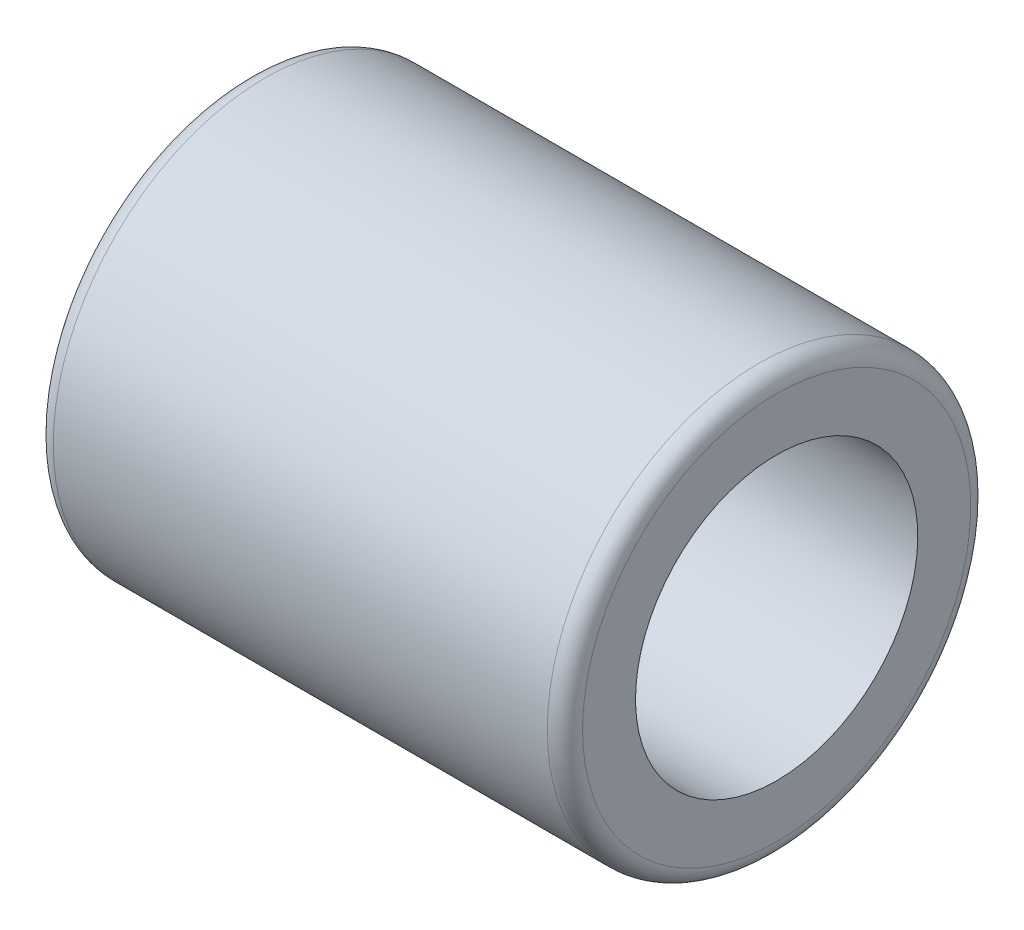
ISO-10303-21;
HEADER;
FILE_DESCRIPTION(('STEP AP214'),'2;1');
FILE_NAME('part.step','',(''),(''),'','','');
FILE_SCHEMA(('AUTOMOTIVE_DESIGN { 1 0 10303 214 1 1 1 1 }'));
ENDSEC;
DATA;
#1=APPLICATION_CONTEXT('core data for automotive mechanical design processes');
#2=APPLICATION_PROTOCOL_DEFINITION('international standard','automotive_design',2000,#1);
#3=PRODUCT_CONTEXT('',#1,'mechanical');
#4=PRODUCT('Part','Part','',(#3));
#5=PRODUCT_RELATED_PRODUCT_CATEGORY('part','',(#4));
#6=PRODUCT_DEFINITION_FORMATION('','',#4);
#7=PRODUCT_DEFINITION_CONTEXT('part definition',#1,'design');
#8=PRODUCT_DEFINITION('design','',#6,#7);
#9=PRODUCT_DEFINITION_SHAPE('','',#8);
#10=(LENGTH_UNIT() NAMED_UNIT(*) SI_UNIT(.MILLI.,.METRE.));
#11=(NAMED_UNIT(*) PLANE_ANGLE_UNIT() SI_UNIT($,.RADIAN.));
#12=(NAMED_UNIT(*) SI_UNIT($,.STERADIAN.) SOLID_ANGLE_UNIT());
#13=UNCERTAINTY_MEASURE_WITH_UNIT(LENGTH_MEASURE(1.E-05),#10,'distance_accuracy_value','');
#14=(GEOMETRIC_REPRESENTATION_CONTEXT(3) GLOBAL_UNCERTAINTY_ASSIGNED_CONTEXT((#13)) GLOBAL_UNIT_ASSIGNED_CONTEXT((#10,
#11,#12)) REPRESENTATION_CONTEXT('',''));
#15=CARTESIAN_POINT('',(0.,0.,0.));
#16=DIRECTION('',(0.,0.,1.));
#17=DIRECTION('',(1.,0.,0.));
#18=AXIS2_PLACEMENT_3D('',#15,#16,#17);
#19=CARTESIAN_POINT('',(0.,9.5,0.));
#20=DIRECTION('',(-1.,0.,0.));
#21=DIRECTION('',(0.,1.,0.));
#22=AXIS2_PLACEMENT_3D('',#19,#20,#21);
#23=PLANE('',#22);
#24=CARTESIAN_POINT('',(0.,0.,0.));
#25=DIRECTION('',(1.,0.,0.));
#26=DIRECTION('',(0.,1.,0.));
#27=AXIS2_PLACEMENT_3D('',#24,#25,#26);
#28=CIRCLE('',#27,8.);
#29=CARTESIAN_POINT('',(0.,-8.,0.));
#30=VERTEX_POINT('',#29);
#31=EDGE_CURVE('E99',#30,#30,#28,.T.);
#32=ORIENTED_EDGE('',*,*,#31,.T.);
#33=EDGE_LOOP('',(#32));
#34=FACE_BOUND('',#33,.T.);
#35=CARTESIAN_POINT('',(0.,0.,0.));
#36=DIRECTION('',(1.,0.,0.));
#37=DIRECTION('',(0.,1.,0.));
#38=AXIS2_PLACEMENT_3D('',#35,#36,#37);
#39=CIRCLE('',#38,11.);
#40=CARTESIAN_POINT('',(0.,11.,0.));
#41=VERTEX_POINT('',#40);
#42=CARTESIAN_POINT('',(0.,0.,11.));
#43=VERTEX_POINT('',#42);
#44=EDGE_CURVE('E106',#41,#43,#39,.T.);
#45=ORIENTED_EDGE('',*,*,#44,.F.);
#46=CARTESIAN_POINT('',(0.,0.,0.));
#47=DIRECTION('',(1.,0.,0.));
#48=DIRECTION('',(0.,1.,0.));
#49=AXIS2_PLACEMENT_3D('',#46,#47,#48);
#50=CIRCLE('',#49,11.);
#51=EDGE_CURVE('E98',#43,#41,#50,.T.);
#52=ORIENTED_EDGE('',*,*,#51,.F.);
#53=EDGE_LOOP('',(#45,#52));
#54=FACE_BOUND('',#53,.T.);
#55=ADVANCED_FACE('F16',(#34,#54),#23,.T.);
#56=CARTESIAN_POINT('',(30.,9.5,0.));
#57=DIRECTION('',(1.,0.,0.));
#58=DIRECTION('',(0.,1.,0.));
#59=AXIS2_PLACEMENT_3D('',#56,#57,#58);
#60=PLANE('',#59);
#61=CARTESIAN_POINT('',(30.,0.,0.));
#62=DIRECTION('',(1.,0.,0.));
#63=DIRECTION('',(0.,1.,0.));
#64=AXIS2_PLACEMENT_3D('',#61,#62,#63);
#65=CIRCLE('',#64,8.);
#66=CARTESIAN_POINT('',(30.,-8.,0.));
#67=VERTEX_POINT('',#66);
#68=EDGE_CURVE('E112',#67,#67,#65,.T.);
#69=ORIENTED_EDGE('',*,*,#68,.F.);
#70=EDGE_LOOP('',(#69));
#71=FACE_BOUND('',#70,.T.);
#72=CARTESIAN_POINT('',(30.,0.,0.));
#73=DIRECTION('',(1.,0.,0.));
#74=DIRECTION('',(0.,1.,0.));
#75=AXIS2_PLACEMENT_3D('',#72,#73,#74);
#76=CIRCLE('',#75,11.);
#77=CARTESIAN_POINT('',(30.,11.,0.));
#78=VERTEX_POINT('',#77);
#79=CARTESIAN_POINT('',(30.,0.,11.));
#80=VERTEX_POINT('',#79);
#81=EDGE_CURVE('E102',#78,#80,#76,.T.);
#82=ORIENTED_EDGE('',*,*,#81,.T.);
#83=CARTESIAN_POINT('',(30.,0.,0.));
#84=DIRECTION('',(1.,0.,0.));
#85=DIRECTION('',(0.,1.,0.));
#86=AXIS2_PLACEMENT_3D('',#83,#84,#85);
#87=CIRCLE('',#86,11.);
#88=EDGE_CURVE('E116',#80,#78,#87,.T.);
#89=ORIENTED_EDGE('',*,*,#88,.T.);
#90=EDGE_LOOP('',(#82,#89));
#91=FACE_BOUND('',#90,.T.);
#92=ADVANCED_FACE('F129',(#71,#91),#60,.T.);
#93=CARTESIAN_POINT('',(15.,0.,0.));
#94=DIRECTION('',(-1.,0.,0.));
#95=DIRECTION('',(0.,1.,0.));
#96=AXIS2_PLACEMENT_3D('',#93,#94,#95);
#97=CYLINDRICAL_SURFACE('',#96,12.);
#98=CARTESIAN_POINT('',(1.,0.,0.));
#99=DIRECTION('',(1.,0.,0.));
#100=DIRECTION('',(0.,1.,0.));
#101=AXIS2_PLACEMENT_3D('',#98,#99,#100);
#102=CIRCLE('',#101,12.);
#103=CARTESIAN_POINT('',(1.,-12.,0.));
#104=VERTEX_POINT('',#103);
#105=CARTESIAN_POINT('',(1.,0.,12.));
#106=VERTEX_POINT('',#105);
#107=EDGE_CURVE('E76',#104,#106,#102,.T.);
#108=ORIENTED_EDGE('',*,*,#107,.T.);
#109=CARTESIAN_POINT('',(1.,0.,0.));
#110=DIRECTION('',(1.,0.,0.));
#111=DIRECTION('',(0.,1.,0.));
#112=AXIS2_PLACEMENT_3D('',#109,#110,#111);
#113=CIRCLE('',#112,12.);
#114=EDGE_CURVE('E78',#106,#104,#113,.T.);
#115=ORIENTED_EDGE('',*,*,#114,.T.);
#116=DIRECTION('',(1.,0.,0.));
#117=VECTOR('',#116,1.);
#118=CARTESIAN_POINT('',(15.,-12.,0.));
#119=LINE('',#118,#117);
#120=CARTESIAN_POINT('',(29.,-12.,0.));
#121=VERTEX_POINT('',#120);
#122=EDGE_CURVE('E10',#104,#121,#119,.T.);
#123=ORIENTED_EDGE('',*,*,#122,.T.);
#124=CARTESIAN_POINT('',(29.,0.,0.));
#125=DIRECTION('',(1.,0.,0.));
#126=DIRECTION('',(0.,1.,0.));
#127=AXIS2_PLACEMENT_3D('',#124,#125,#126);
#128=CIRCLE('',#127,12.);
#129=CARTESIAN_POINT('',(29.,0.,12.));
#130=VERTEX_POINT('',#129);
#131=EDGE_CURVE('E94',#130,#121,#128,.T.);
#132=ORIENTED_EDGE('',*,*,#131,.F.);
#133=CARTESIAN_POINT('',(29.,0.,0.));
#134=DIRECTION('',(1.,0.,0.));
#135=DIRECTION('',(0.,1.,0.));
#136=AXIS2_PLACEMENT_3D('',#133,#134,#135);
#137=CIRCLE('',#136,12.);
#138=EDGE_CURVE('E24',#121,#130,#137,.T.);
#139=ORIENTED_EDGE('',*,*,#138,.F.);
#140=ORIENTED_EDGE('',*,*,#122,.F.);
#141=EDGE_LOOP('',(#108,#115,#123,#132,#139,#140));
#142=FACE_BOUND('',#141,.T.);
#143=ADVANCED_FACE('F74',(#142),#97,.T.);
#144=CARTESIAN_POINT('',(29.,0.,0.));
#145=DIRECTION('',(1.,0.,0.));
#146=DIRECTION('',(0.,0.,-1.));
#147=AXIS2_PLACEMENT_3D('',#144,#145,#146);
#148=TOROIDAL_SURFACE('',#147,11.,1.);
#149=ORIENTED_EDGE('',*,*,#81,.F.);
#150=ORIENTED_EDGE('',*,*,#88,.F.);
#151=CARTESIAN_POINT('',(29.,0.,11.));
#152=DIRECTION('',(0.,-1.,0.));
#153=DIRECTION('',(0.,0.,1.));
#154=AXIS2_PLACEMENT_3D('',#151,#152,#153);
#155=CIRCLE('',#154,1.);
#156=EDGE_CURVE('E109',#80,#130,#155,.T.);
#157=ORIENTED_EDGE('',*,*,#156,.T.);
#158=ORIENTED_EDGE('',*,*,#131,.T.);
#159=ORIENTED_EDGE('',*,*,#138,.T.);
#160=ORIENTED_EDGE('',*,*,#156,.F.);
#161=EDGE_LOOP('',(#149,#150,#157,#158,#159,#160));
#162=FACE_BOUND('',#161,.T.);
#163=ADVANCED_FACE('F127',(#162),#148,.T.);
#164=CARTESIAN_POINT('',(15.,0.,0.));
#165=DIRECTION('',(-1.,0.,0.));
#166=DIRECTION('',(0.,1.,0.));
#167=AXIS2_PLACEMENT_3D('',#164,#165,#166);
#168=CYLINDRICAL_SURFACE('',#167,8.);
#169=ORIENTED_EDGE('',*,*,#68,.T.);
#170=DIRECTION('',(-1.,0.,0.));
#171=VECTOR('',#170,1.);
#172=CARTESIAN_POINT('',(15.,-8.,0.));
#173=LINE('',#172,#171);
#174=EDGE_CURVE('E92',#67,#30,#173,.T.);
#175=ORIENTED_EDGE('',*,*,#174,.T.);
#176=ORIENTED_EDGE('',*,*,#31,.F.);
#177=ORIENTED_EDGE('',*,*,#174,.F.);
#178=EDGE_LOOP('',(#169,#175,#176,#177));
#179=FACE_BOUND('',#178,.T.);
#180=ADVANCED_FACE('F143',(#179),#168,.F.);
#181=CARTESIAN_POINT('',(1.,0.,0.));
#182=DIRECTION('',(1.,0.,0.));
#183=DIRECTION('',(0.,0.,-1.));
#184=AXIS2_PLACEMENT_3D('',#181,#182,#183);
#185=TOROIDAL_SURFACE('',#184,11.,1.);
#186=ORIENTED_EDGE('',*,*,#107,.F.);
#187=ORIENTED_EDGE('',*,*,#114,.F.);
#188=CARTESIAN_POINT('',(1.,0.,11.));
#189=DIRECTION('',(0.,-1.,0.));
#190=DIRECTION('',(0.,0.,1.));
#191=AXIS2_PLACEMENT_3D('',#188,#189,#190);
#192=CIRCLE('',#191,1.);
#193=EDGE_CURVE('E82',#106,#43,#192,.T.);
#194=ORIENTED_EDGE('',*,*,#193,.T.);
#195=ORIENTED_EDGE('',*,*,#51,.T.);
#196=ORIENTED_EDGE('',*,*,#44,.T.);
#197=ORIENTED_EDGE('',*,*,#193,.F.);
#198=EDGE_LOOP('',(#186,#187,#194,#195,#196,#197));
#199=FACE_BOUND('',#198,.T.);
#200=ADVANCED_FACE('F84',(#199),#185,.T.);
#201=CLOSED_SHELL('',(#55,#92,#143,#163,#180,#200));
#202=MANIFOLD_SOLID_BREP('B1',#201);
#203=ADVANCED_BREP_SHAPE_REPRESENTATION('',(#18,#202),#14);
#204=SHAPE_DEFINITION_REPRESENTATION(#9,#203);
ENDSEC;
END-ISO-10303-21;
